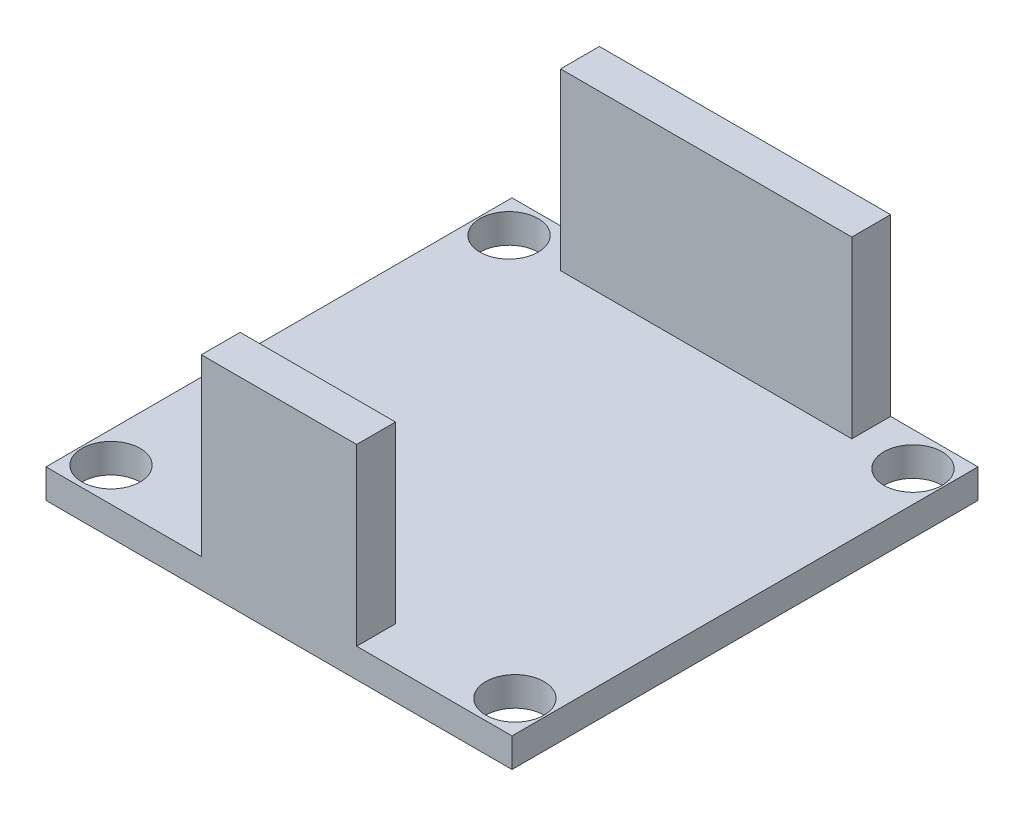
ISO-10303-21;
HEADER;
FILE_DESCRIPTION(('STEP AP214'),'2;1');
FILE_NAME('part.step','',(''),(''),'','','');
FILE_SCHEMA(('AUTOMOTIVE_DESIGN { 1 0 10303 214 1 1 1 1 }'));
ENDSEC;
DATA;
#1=APPLICATION_CONTEXT('core data for automotive mechanical design processes');
#2=APPLICATION_PROTOCOL_DEFINITION('international standard','automotive_design',2000,#1);
#3=PRODUCT_CONTEXT('',#1,'mechanical');
#4=PRODUCT('Part','Part','',(#3));
#5=PRODUCT_RELATED_PRODUCT_CATEGORY('part','',(#4));
#6=PRODUCT_DEFINITION_FORMATION('','',#4);
#7=PRODUCT_DEFINITION_CONTEXT('part definition',#1,'design');
#8=PRODUCT_DEFINITION('design','',#6,#7);
#9=PRODUCT_DEFINITION_SHAPE('','',#8);
#10=(LENGTH_UNIT() NAMED_UNIT(*) SI_UNIT(.MILLI.,.METRE.));
#11=(NAMED_UNIT(*) PLANE_ANGLE_UNIT() SI_UNIT($,.RADIAN.));
#12=(NAMED_UNIT(*) SI_UNIT($,.STERADIAN.) SOLID_ANGLE_UNIT());
#13=UNCERTAINTY_MEASURE_WITH_UNIT(LENGTH_MEASURE(1.E-05),#10,'distance_accuracy_value','');
#14=(GEOMETRIC_REPRESENTATION_CONTEXT(3) GLOBAL_UNCERTAINTY_ASSIGNED_CONTEXT((#13)) GLOBAL_UNIT_ASSIGNED_CONTEXT((#10,
#11,#12)) REPRESENTATION_CONTEXT('',''));
#15=CARTESIAN_POINT('',(0.,0.,0.));
#16=DIRECTION('',(0.,0.,1.));
#17=DIRECTION('',(1.,0.,0.));
#18=AXIS2_PLACEMENT_3D('',#15,#16,#17);
#19=CARTESIAN_POINT('',(0.,1.5,0.));
#20=DIRECTION('',(1.,0.,0.));
#21=DIRECTION('',(0.,0.,-1.));
#22=AXIS2_PLACEMENT_3D('',#19,#20,#21);
#23=PLANE('',#22);
#24=DIRECTION('',(0.,0.,1.));
#25=VECTOR('',#24,1.);
#26=CARTESIAN_POINT('',(0.,0.,0.));
#27=LINE('',#26,#25);
#28=CARTESIAN_POINT('',(0.,0.,0.));
#29=VERTEX_POINT('',#28);
#30=CARTESIAN_POINT('',(0.,0.,24.));
#31=VERTEX_POINT('',#30);
#32=EDGE_CURVE('E214',#29,#31,#27,.T.);
#33=ORIENTED_EDGE('',*,*,#32,.T.);
#34=DIRECTION('',(0.,-1.,0.));
#35=VECTOR('',#34,1.);
#36=CARTESIAN_POINT('',(0.,1.5,24.));
#37=LINE('',#36,#35);
#38=CARTESIAN_POINT('',(0.,1.5,24.));
#39=VERTEX_POINT('',#38);
#40=EDGE_CURVE('E11',#39,#31,#37,.T.);
#41=ORIENTED_EDGE('',*,*,#40,.F.);
#42=DIRECTION('',(0.,0.,1.));
#43=VECTOR('',#42,1.);
#44=CARTESIAN_POINT('',(0.,1.5,0.));
#45=LINE('',#44,#43);
#46=CARTESIAN_POINT('',(0.,1.5,0.));
#47=VERTEX_POINT('',#46);
#48=EDGE_CURVE('E217',#47,#39,#45,.T.);
#49=ORIENTED_EDGE('',*,*,#48,.F.);
#50=DIRECTION('',(0.,-1.,0.));
#51=VECTOR('',#50,1.);
#52=CARTESIAN_POINT('',(0.,1.5,0.));
#53=LINE('',#52,#51);
#54=EDGE_CURVE('E230',#47,#29,#53,.T.);
#55=ORIENTED_EDGE('',*,*,#54,.T.);
#56=EDGE_LOOP('',(#33,#41,#49,#55));
#57=FACE_BOUND('',#56,.T.);
#58=ADVANCED_FACE('F41',(#57),#23,.F.);
#59=CARTESIAN_POINT('',(0.,1.5,24.));
#60=DIRECTION('',(0.,0.,-1.));
#61=DIRECTION('',(-1.,0.,0.));
#62=AXIS2_PLACEMENT_3D('',#59,#60,#61);
#63=PLANE('',#62);
#64=DIRECTION('',(1.,0.,0.));
#65=VECTOR('',#64,1.);
#66=CARTESIAN_POINT('',(0.,0.,24.));
#67=LINE('',#66,#65);
#68=CARTESIAN_POINT('',(24.,0.,24.));
#69=VERTEX_POINT('',#68);
#70=EDGE_CURVE('E233',#31,#69,#67,.T.);
#71=ORIENTED_EDGE('',*,*,#70,.T.);
#72=DIRECTION('',(0.,-1.,0.));
#73=VECTOR('',#72,1.);
#74=CARTESIAN_POINT('',(24.,1.5,24.));
#75=LINE('',#74,#73);
#76=CARTESIAN_POINT('',(24.,1.5,24.));
#77=VERTEX_POINT('',#76);
#78=EDGE_CURVE('E48',#77,#69,#75,.T.);
#79=ORIENTED_EDGE('',*,*,#78,.F.);
#80=DIRECTION('',(1.,0.,0.));
#81=VECTOR('',#80,1.);
#82=CARTESIAN_POINT('',(0.,1.5,24.));
#83=LINE('',#82,#81);
#84=CARTESIAN_POINT('',(16.,1.5,24.));
#85=VERTEX_POINT('',#84);
#86=EDGE_CURVE('E220',#85,#77,#83,.T.);
#87=ORIENTED_EDGE('',*,*,#86,.F.);
#88=DIRECTION('',(0.,-1.,0.));
#89=VECTOR('',#88,1.);
#90=CARTESIAN_POINT('',(16.,10.5,24.));
#91=LINE('',#90,#89);
#92=CARTESIAN_POINT('',(16.,10.5,24.));
#93=VERTEX_POINT('',#92);
#94=EDGE_CURVE('E186',#93,#85,#91,.T.);
#95=ORIENTED_EDGE('',*,*,#94,.F.);
#96=DIRECTION('',(1.,0.,0.));
#97=VECTOR('',#96,1.);
#98=CARTESIAN_POINT('',(0.,10.5,24.));
#99=LINE('',#98,#97);
#100=CARTESIAN_POINT('',(8.,10.5,24.));
#101=VERTEX_POINT('',#100);
#102=EDGE_CURVE('E174',#101,#93,#99,.T.);
#103=ORIENTED_EDGE('',*,*,#102,.F.);
#104=DIRECTION('',(0.,-1.,0.));
#105=VECTOR('',#104,1.);
#106=CARTESIAN_POINT('',(8.,10.5,24.));
#107=LINE('',#106,#105);
#108=CARTESIAN_POINT('',(8.,1.5,24.));
#109=VERTEX_POINT('',#108);
#110=EDGE_CURVE('E188',#101,#109,#107,.T.);
#111=ORIENTED_EDGE('',*,*,#110,.T.);
#112=EDGE_CURVE('E222',#39,#109,#83,.T.);
#113=ORIENTED_EDGE('',*,*,#112,.F.);
#114=ORIENTED_EDGE('',*,*,#40,.T.);
#115=EDGE_LOOP('',(#71,#79,#87,#95,#103,#111,#113,#114));
#116=FACE_BOUND('',#115,.T.);
#117=ADVANCED_FACE('F269',(#116),#63,.F.);
#118=CARTESIAN_POINT('',(24.,1.5,0.));
#119=DIRECTION('',(-1.,0.,0.));
#120=DIRECTION('',(0.,0.,1.));
#121=AXIS2_PLACEMENT_3D('',#118,#119,#120);
#122=PLANE('',#121);
#123=DIRECTION('',(0.,0.,-1.));
#124=VECTOR('',#123,1.);
#125=CARTESIAN_POINT('',(24.,0.,0.));
#126=LINE('',#125,#124);
#127=CARTESIAN_POINT('',(24.,0.,0.));
#128=VERTEX_POINT('',#127);
#129=EDGE_CURVE('E235',#69,#128,#126,.T.);
#130=ORIENTED_EDGE('',*,*,#129,.T.);
#131=DIRECTION('',(0.,-1.,0.));
#132=VECTOR('',#131,1.);
#133=CARTESIAN_POINT('',(24.,1.5,0.));
#134=LINE('',#133,#132);
#135=CARTESIAN_POINT('',(24.,1.5,0.));
#136=VERTEX_POINT('',#135);
#137=EDGE_CURVE('E240',#136,#128,#134,.T.);
#138=ORIENTED_EDGE('',*,*,#137,.F.);
#139=DIRECTION('',(0.,0.,-1.));
#140=VECTOR('',#139,1.);
#141=CARTESIAN_POINT('',(24.,1.5,0.));
#142=LINE('',#141,#140);
#143=EDGE_CURVE('E225',#77,#136,#142,.T.);
#144=ORIENTED_EDGE('',*,*,#143,.F.);
#145=ORIENTED_EDGE('',*,*,#78,.T.);
#146=EDGE_LOOP('',(#130,#138,#144,#145));
#147=FACE_BOUND('',#146,.T.);
#148=ADVANCED_FACE('F247',(#147),#122,.F.);
#149=CARTESIAN_POINT('',(0.,1.5,0.));
#150=DIRECTION('',(0.,0.,1.));
#151=DIRECTION('',(1.,0.,0.));
#152=AXIS2_PLACEMENT_3D('',#149,#150,#151);
#153=PLANE('',#152);
#154=DIRECTION('',(-1.,0.,0.));
#155=VECTOR('',#154,1.);
#156=CARTESIAN_POINT('',(0.,0.,0.));
#157=LINE('',#156,#155);
#158=EDGE_CURVE('E221',#128,#29,#157,.T.);
#159=ORIENTED_EDGE('',*,*,#158,.T.);
#160=ORIENTED_EDGE('',*,*,#54,.F.);
#161=DIRECTION('',(-1.,0.,0.));
#162=VECTOR('',#161,1.);
#163=CARTESIAN_POINT('',(0.,1.5,0.));
#164=LINE('',#163,#162);
#165=CARTESIAN_POINT('',(4.5,1.5,0.));
#166=VERTEX_POINT('',#165);
#167=EDGE_CURVE('E227',#166,#47,#164,.T.);
#168=ORIENTED_EDGE('',*,*,#167,.F.);
#169=DIRECTION('',(0.,-1.,0.));
#170=VECTOR('',#169,1.);
#171=CARTESIAN_POINT('',(4.5,10.5,0.));
#172=LINE('',#171,#170);
#173=CARTESIAN_POINT('',(4.5,10.5,0.));
#174=VERTEX_POINT('',#173);
#175=EDGE_CURVE('E141',#174,#166,#172,.T.);
#176=ORIENTED_EDGE('',*,*,#175,.F.);
#177=DIRECTION('',(-1.,0.,0.));
#178=VECTOR('',#177,1.);
#179=CARTESIAN_POINT('',(0.,10.5,0.));
#180=LINE('',#179,#178);
#181=CARTESIAN_POINT('',(19.5,10.5,0.));
#182=VERTEX_POINT('',#181);
#183=EDGE_CURVE('E144',#182,#174,#180,.T.);
#184=ORIENTED_EDGE('',*,*,#183,.F.);
#185=DIRECTION('',(0.,-1.,0.));
#186=VECTOR('',#185,1.);
#187=CARTESIAN_POINT('',(19.5,10.5,0.));
#188=LINE('',#187,#186);
#189=CARTESIAN_POINT('',(19.5,1.5,0.));
#190=VERTEX_POINT('',#189);
#191=EDGE_CURVE('E131',#182,#190,#188,.T.);
#192=ORIENTED_EDGE('',*,*,#191,.T.);
#193=EDGE_CURVE('E228',#136,#190,#164,.T.);
#194=ORIENTED_EDGE('',*,*,#193,.F.);
#195=ORIENTED_EDGE('',*,*,#137,.T.);
#196=EDGE_LOOP('',(#159,#160,#168,#176,#184,#192,#194,#195));
#197=FACE_BOUND('',#196,.T.);
#198=ADVANCED_FACE('F145',(#197),#153,.F.);
#199=CARTESIAN_POINT('',(0.,1.5,0.));
#200=DIRECTION('',(0.,1.,0.));
#201=DIRECTION('',(0.,0.,1.));
#202=AXIS2_PLACEMENT_3D('',#199,#200,#201);
#203=PLANE('',#202);
#204=DIRECTION('',(0.,0.,1.));
#205=VECTOR('',#204,1.);
#206=CARTESIAN_POINT('',(19.5,1.5,0.));
#207=LINE('',#206,#205);
#208=CARTESIAN_POINT('',(19.5,1.5,2.));
#209=VERTEX_POINT('',#208);
#210=EDGE_CURVE('E137',#190,#209,#207,.T.);
#211=ORIENTED_EDGE('',*,*,#210,.T.);
#212=DIRECTION('',(1.,0.,0.));
#213=VECTOR('',#212,1.);
#214=CARTESIAN_POINT('',(0.,1.5,2.));
#215=LINE('',#214,#213);
#216=CARTESIAN_POINT('',(4.5,1.5,2.));
#217=VERTEX_POINT('',#216);
#218=EDGE_CURVE('E154',#217,#209,#215,.T.);
#219=ORIENTED_EDGE('',*,*,#218,.F.);
#220=DIRECTION('',(0.,0.,1.));
#221=VECTOR('',#220,1.);
#222=CARTESIAN_POINT('',(4.5,1.5,0.));
#223=LINE('',#222,#221);
#224=EDGE_CURVE('E156',#166,#217,#223,.T.);
#225=ORIENTED_EDGE('',*,*,#224,.F.);
#226=ORIENTED_EDGE('',*,*,#167,.T.);
#227=ORIENTED_EDGE('',*,*,#48,.T.);
#228=ORIENTED_EDGE('',*,*,#112,.T.);
#229=DIRECTION('',(0.,0.,-1.));
#230=VECTOR('',#229,1.);
#231=CARTESIAN_POINT('',(8.,1.5,0.));
#232=LINE('',#231,#230);
#233=CARTESIAN_POINT('',(8.,1.5,22.));
#234=VERTEX_POINT('',#233);
#235=EDGE_CURVE('E180',#109,#234,#232,.T.);
#236=ORIENTED_EDGE('',*,*,#235,.T.);
#237=DIRECTION('',(1.,0.,0.));
#238=VECTOR('',#237,1.);
#239=CARTESIAN_POINT('',(0.,1.5,22.));
#240=LINE('',#239,#238);
#241=CARTESIAN_POINT('',(16.,1.5,22.));
#242=VERTEX_POINT('',#241);
#243=EDGE_CURVE('E63',#234,#242,#240,.T.);
#244=ORIENTED_EDGE('',*,*,#243,.T.);
#245=DIRECTION('',(0.,0.,-1.));
#246=VECTOR('',#245,1.);
#247=CARTESIAN_POINT('',(16.,1.5,0.));
#248=LINE('',#247,#246);
#249=EDGE_CURVE('E171',#85,#242,#248,.T.);
#250=ORIENTED_EDGE('',*,*,#249,.F.);
#251=ORIENTED_EDGE('',*,*,#86,.T.);
#252=ORIENTED_EDGE('',*,*,#143,.T.);
#253=ORIENTED_EDGE('',*,*,#193,.T.);
#254=EDGE_LOOP('',(#211,#219,#225,#226,#227,#228,#236,#244,#250,#251,#252,#253));
#255=FACE_BOUND('',#254,.T.);
#256=CARTESIAN_POINT('',(1.6,1.5,1.75));
#257=DIRECTION('',(0.,1.,0.));
#258=DIRECTION('',(0.,0.,-1.));
#259=AXIS2_PLACEMENT_3D('',#256,#257,#258);
#260=CIRCLE('',#259,1.5);
#261=CARTESIAN_POINT('',(1.6,1.5,0.25));
#262=VERTEX_POINT('',#261);
#263=EDGE_CURVE('E192',#262,#262,#260,.T.);
#264=ORIENTED_EDGE('',*,*,#263,.F.);
#265=EDGE_LOOP('',(#264));
#266=FACE_BOUND('',#265,.T.);
#267=CARTESIAN_POINT('',(1.6,1.5,22.25));
#268=DIRECTION('',(0.,1.,0.));
#269=DIRECTION('',(0.,0.,1.));
#270=AXIS2_PLACEMENT_3D('',#267,#268,#269);
#271=CIRCLE('',#270,1.5);
#272=CARTESIAN_POINT('',(1.6,1.5,23.75));
#273=VERTEX_POINT('',#272);
#274=EDGE_CURVE('E203',#273,#273,#271,.T.);
#275=ORIENTED_EDGE('',*,*,#274,.F.);
#276=EDGE_LOOP('',(#275));
#277=FACE_BOUND('',#276,.T.);
#278=CARTESIAN_POINT('',(22.4,1.5,22.25));
#279=DIRECTION('',(0.,1.,0.));
#280=DIRECTION('',(0.,0.,-1.));
#281=AXIS2_PLACEMENT_3D('',#278,#279,#280);
#282=CIRCLE('',#281,1.5);
#283=CARTESIAN_POINT('',(22.4,1.5,20.75));
#284=VERTEX_POINT('',#283);
#285=EDGE_CURVE('E197',#284,#284,#282,.T.);
#286=ORIENTED_EDGE('',*,*,#285,.F.);
#287=EDGE_LOOP('',(#286));
#288=FACE_BOUND('',#287,.T.);
#289=CARTESIAN_POINT('',(22.4,1.5,1.75));
#290=DIRECTION('',(0.,1.,0.));
#291=DIRECTION('',(0.,0.,1.));
#292=AXIS2_PLACEMENT_3D('',#289,#290,#291);
#293=CIRCLE('',#292,1.5);
#294=CARTESIAN_POINT('',(22.4,1.5,3.25));
#295=VERTEX_POINT('',#294);
#296=EDGE_CURVE('E196',#295,#295,#293,.T.);
#297=ORIENTED_EDGE('',*,*,#296,.F.);
#298=EDGE_LOOP('',(#297));
#299=FACE_BOUND('',#298,.T.);
#300=ADVANCED_FACE('F260',(#255,#266,#277,#288,#299),#203,.T.);
#301=CARTESIAN_POINT('',(0.,0.,0.));
#302=DIRECTION('',(0.,1.,0.));
#303=DIRECTION('',(0.,0.,1.));
#304=AXIS2_PLACEMENT_3D('',#301,#302,#303);
#305=PLANE('',#304);
#306=CARTESIAN_POINT('',(1.6,0.,1.75));
#307=DIRECTION('',(0.,1.,0.));
#308=DIRECTION('',(0.,0.,-1.));
#309=AXIS2_PLACEMENT_3D('',#306,#307,#308);
#310=CIRCLE('',#309,1.5);
#311=CARTESIAN_POINT('',(1.6,0.,0.25));
#312=VERTEX_POINT('',#311);
#313=EDGE_CURVE('E206',#312,#312,#310,.T.);
#314=ORIENTED_EDGE('',*,*,#313,.T.);
#315=EDGE_LOOP('',(#314));
#316=FACE_BOUND('',#315,.T.);
#317=CARTESIAN_POINT('',(1.6,0.,22.25));
#318=DIRECTION('',(0.,1.,0.));
#319=DIRECTION('',(0.,0.,1.));
#320=AXIS2_PLACEMENT_3D('',#317,#318,#319);
#321=CIRCLE('',#320,1.5);
#322=CARTESIAN_POINT('',(1.6,0.,23.75));
#323=VERTEX_POINT('',#322);
#324=EDGE_CURVE('E200',#323,#323,#321,.T.);
#325=ORIENTED_EDGE('',*,*,#324,.T.);
#326=EDGE_LOOP('',(#325));
#327=FACE_BOUND('',#326,.T.);
#328=CARTESIAN_POINT('',(22.4,0.,22.25));
#329=DIRECTION('',(0.,1.,0.));
#330=DIRECTION('',(0.,0.,-1.));
#331=AXIS2_PLACEMENT_3D('',#328,#329,#330);
#332=CIRCLE('',#331,1.5);
#333=CARTESIAN_POINT('',(22.4,0.,20.75));
#334=VERTEX_POINT('',#333);
#335=EDGE_CURVE('E193',#334,#334,#332,.T.);
#336=ORIENTED_EDGE('',*,*,#335,.T.);
#337=EDGE_LOOP('',(#336));
#338=FACE_BOUND('',#337,.T.);
#339=CARTESIAN_POINT('',(22.4,0.,1.75));
#340=DIRECTION('',(0.,1.,0.));
#341=DIRECTION('',(0.,0.,1.));
#342=AXIS2_PLACEMENT_3D('',#339,#340,#341);
#343=CIRCLE('',#342,1.5);
#344=CARTESIAN_POINT('',(22.4,0.,3.25));
#345=VERTEX_POINT('',#344);
#346=EDGE_CURVE('E211',#345,#345,#343,.T.);
#347=ORIENTED_EDGE('',*,*,#346,.T.);
#348=EDGE_LOOP('',(#347));
#349=FACE_BOUND('',#348,.T.);
#350=ORIENTED_EDGE('',*,*,#32,.F.);
#351=ORIENTED_EDGE('',*,*,#158,.F.);
#352=ORIENTED_EDGE('',*,*,#129,.F.);
#353=ORIENTED_EDGE('',*,*,#70,.F.);
#354=EDGE_LOOP('',(#350,#351,#352,#353));
#355=FACE_BOUND('',#354,.T.);
#356=ADVANCED_FACE('F254',(#316,#327,#338,#349,#355),#305,.F.);
#357=CARTESIAN_POINT('',(22.4,0.,1.75));
#358=DIRECTION('',(0.,1.,0.));
#359=DIRECTION('',(0.,0.,1.));
#360=AXIS2_PLACEMENT_3D('',#357,#358,#359);
#361=CYLINDRICAL_SURFACE('',#360,1.5);
#362=ORIENTED_EDGE('',*,*,#346,.F.);
#363=EDGE_LOOP('',(#362));
#364=FACE_BOUND('',#363,.T.);
#365=ORIENTED_EDGE('',*,*,#296,.T.);
#366=EDGE_LOOP('',(#365));
#367=FACE_BOUND('',#366,.T.);
#368=ADVANCED_FACE('F308',(#364,#367),#361,.F.);
#369=CARTESIAN_POINT('',(22.4,0.,22.25));
#370=DIRECTION('',(0.,1.,0.));
#371=DIRECTION('',(0.,0.,1.));
#372=AXIS2_PLACEMENT_3D('',#369,#370,#371);
#373=CYLINDRICAL_SURFACE('',#372,1.5);
#374=ORIENTED_EDGE('',*,*,#335,.F.);
#375=EDGE_LOOP('',(#374));
#376=FACE_BOUND('',#375,.T.);
#377=ORIENTED_EDGE('',*,*,#285,.T.);
#378=EDGE_LOOP('',(#377));
#379=FACE_BOUND('',#378,.T.);
#380=ADVANCED_FACE('F313',(#376,#379),#373,.F.);
#381=CARTESIAN_POINT('',(1.6,0.,22.25));
#382=DIRECTION('',(0.,1.,0.));
#383=DIRECTION('',(0.,0.,1.));
#384=AXIS2_PLACEMENT_3D('',#381,#382,#383);
#385=CYLINDRICAL_SURFACE('',#384,1.5);
#386=ORIENTED_EDGE('',*,*,#324,.F.);
#387=EDGE_LOOP('',(#386));
#388=FACE_BOUND('',#387,.T.);
#389=ORIENTED_EDGE('',*,*,#274,.T.);
#390=EDGE_LOOP('',(#389));
#391=FACE_BOUND('',#390,.T.);
#392=ADVANCED_FACE('F291',(#388,#391),#385,.F.);
#393=CARTESIAN_POINT('',(1.6,0.,1.75));
#394=DIRECTION('',(0.,1.,0.));
#395=DIRECTION('',(0.,0.,1.));
#396=AXIS2_PLACEMENT_3D('',#393,#394,#395);
#397=CYLINDRICAL_SURFACE('',#396,1.5);
#398=ORIENTED_EDGE('',*,*,#313,.F.);
#399=EDGE_LOOP('',(#398));
#400=FACE_BOUND('',#399,.T.);
#401=ORIENTED_EDGE('',*,*,#263,.T.);
#402=EDGE_LOOP('',(#401));
#403=FACE_BOUND('',#402,.T.);
#404=ADVANCED_FACE('F284',(#400,#403),#397,.F.);
#405=CARTESIAN_POINT('',(0.,10.5,22.));
#406=DIRECTION('',(0.,0.,-1.));
#407=DIRECTION('',(-1.,0.,0.));
#408=AXIS2_PLACEMENT_3D('',#405,#406,#407);
#409=PLANE('',#408);
#410=ORIENTED_EDGE('',*,*,#243,.F.);
#411=DIRECTION('',(0.,-1.,0.));
#412=VECTOR('',#411,1.);
#413=CARTESIAN_POINT('',(8.,10.5,22.));
#414=LINE('',#413,#412);
#415=CARTESIAN_POINT('',(8.,10.5,22.));
#416=VERTEX_POINT('',#415);
#417=EDGE_CURVE('E190',#416,#234,#414,.T.);
#418=ORIENTED_EDGE('',*,*,#417,.F.);
#419=DIRECTION('',(1.,0.,0.));
#420=VECTOR('',#419,1.);
#421=CARTESIAN_POINT('',(0.,10.5,22.));
#422=LINE('',#421,#420);
#423=CARTESIAN_POINT('',(16.,10.5,22.));
#424=VERTEX_POINT('',#423);
#425=EDGE_CURVE('E167',#416,#424,#422,.T.);
#426=ORIENTED_EDGE('',*,*,#425,.T.);
#427=DIRECTION('',(0.,-1.,0.));
#428=VECTOR('',#427,1.);
#429=CARTESIAN_POINT('',(16.,10.5,22.));
#430=LINE('',#429,#428);
#431=EDGE_CURVE('E178',#424,#242,#430,.T.);
#432=ORIENTED_EDGE('',*,*,#431,.T.);
#433=EDGE_LOOP('',(#410,#418,#426,#432));
#434=FACE_BOUND('',#433,.T.);
#435=ADVANCED_FACE('F282',(#434),#409,.T.);
#436=CARTESIAN_POINT('',(8.,10.5,0.));
#437=DIRECTION('',(-1.,0.,0.));
#438=DIRECTION('',(0.,0.,1.));
#439=AXIS2_PLACEMENT_3D('',#436,#437,#438);
#440=PLANE('',#439);
#441=ORIENTED_EDGE('',*,*,#235,.F.);
#442=ORIENTED_EDGE('',*,*,#110,.F.);
#443=DIRECTION('',(0.,0.,-1.));
#444=VECTOR('',#443,1.);
#445=CARTESIAN_POINT('',(8.,10.5,0.));
#446=LINE('',#445,#444);
#447=EDGE_CURVE('E170',#101,#416,#446,.T.);
#448=ORIENTED_EDGE('',*,*,#447,.T.);
#449=ORIENTED_EDGE('',*,*,#417,.T.);
#450=EDGE_LOOP('',(#441,#442,#448,#449));
#451=FACE_BOUND('',#450,.T.);
#452=ADVANCED_FACE('F281',(#451),#440,.T.);
#453=CARTESIAN_POINT('',(16.,10.5,0.));
#454=DIRECTION('',(-1.,0.,0.));
#455=DIRECTION('',(0.,0.,1.));
#456=AXIS2_PLACEMENT_3D('',#453,#454,#455);
#457=PLANE('',#456);
#458=ORIENTED_EDGE('',*,*,#249,.T.);
#459=ORIENTED_EDGE('',*,*,#431,.F.);
#460=DIRECTION('',(0.,0.,-1.));
#461=VECTOR('',#460,1.);
#462=CARTESIAN_POINT('',(16.,10.5,0.));
#463=LINE('',#462,#461);
#464=EDGE_CURVE('E176',#93,#424,#463,.T.);
#465=ORIENTED_EDGE('',*,*,#464,.F.);
#466=ORIENTED_EDGE('',*,*,#94,.T.);
#467=EDGE_LOOP('',(#458,#459,#465,#466));
#468=FACE_BOUND('',#467,.T.);
#469=ADVANCED_FACE('F275',(#468),#457,.F.);
#470=CARTESIAN_POINT('',(0.,10.5,0.));
#471=DIRECTION('',(0.,1.,0.));
#472=DIRECTION('',(0.,0.,1.));
#473=AXIS2_PLACEMENT_3D('',#470,#471,#472);
#474=PLANE('',#473);
#475=ORIENTED_EDGE('',*,*,#425,.F.);
#476=ORIENTED_EDGE('',*,*,#447,.F.);
#477=ORIENTED_EDGE('',*,*,#102,.T.);
#478=ORIENTED_EDGE('',*,*,#464,.T.);
#479=EDGE_LOOP('',(#475,#476,#477,#478));
#480=FACE_BOUND('',#479,.T.);
#481=ADVANCED_FACE('F278',(#480),#474,.T.);
#482=CARTESIAN_POINT('',(19.5,10.5,0.));
#483=DIRECTION('',(1.,0.,0.));
#484=DIRECTION('',(0.,0.,-1.));
#485=AXIS2_PLACEMENT_3D('',#482,#483,#484);
#486=PLANE('',#485);
#487=ORIENTED_EDGE('',*,*,#210,.F.);
#488=ORIENTED_EDGE('',*,*,#191,.F.);
#489=DIRECTION('',(0.,0.,1.));
#490=VECTOR('',#489,1.);
#491=CARTESIAN_POINT('',(19.5,10.5,0.));
#492=LINE('',#491,#490);
#493=CARTESIAN_POINT('',(19.5,10.5,2.));
#494=VERTEX_POINT('',#493);
#495=EDGE_CURVE('E135',#182,#494,#492,.T.);
#496=ORIENTED_EDGE('',*,*,#495,.T.);
#497=DIRECTION('',(0.,-1.,0.));
#498=VECTOR('',#497,1.);
#499=CARTESIAN_POINT('',(19.5,10.5,2.));
#500=LINE('',#499,#498);
#501=EDGE_CURVE('E161',#494,#209,#500,.T.);
#502=ORIENTED_EDGE('',*,*,#501,.T.);
#503=EDGE_LOOP('',(#487,#488,#496,#502));
#504=FACE_BOUND('',#503,.T.);
#505=ADVANCED_FACE('F133',(#504),#486,.T.);
#506=CARTESIAN_POINT('',(4.5,10.5,0.));
#507=DIRECTION('',(1.,0.,0.));
#508=DIRECTION('',(0.,0.,-1.));
#509=AXIS2_PLACEMENT_3D('',#506,#507,#508);
#510=PLANE('',#509);
#511=ORIENTED_EDGE('',*,*,#224,.T.);
#512=DIRECTION('',(0.,-1.,0.));
#513=VECTOR('',#512,1.);
#514=CARTESIAN_POINT('',(4.5,10.5,2.));
#515=LINE('',#514,#513);
#516=CARTESIAN_POINT('',(4.5,10.5,2.));
#517=VERTEX_POINT('',#516);
#518=EDGE_CURVE('E55',#517,#217,#515,.T.);
#519=ORIENTED_EDGE('',*,*,#518,.F.);
#520=DIRECTION('',(0.,0.,1.));
#521=VECTOR('',#520,1.);
#522=CARTESIAN_POINT('',(4.5,10.5,0.));
#523=LINE('',#522,#521);
#524=EDGE_CURVE('E149',#174,#517,#523,.T.);
#525=ORIENTED_EDGE('',*,*,#524,.F.);
#526=ORIENTED_EDGE('',*,*,#175,.T.);
#527=EDGE_LOOP('',(#511,#519,#525,#526));
#528=FACE_BOUND('',#527,.T.);
#529=ADVANCED_FACE('F265',(#528),#510,.F.);
#530=CARTESIAN_POINT('',(0.,10.5,2.));
#531=DIRECTION('',(0.,0.,-1.));
#532=DIRECTION('',(-1.,0.,0.));
#533=AXIS2_PLACEMENT_3D('',#530,#531,#532);
#534=PLANE('',#533);
#535=ORIENTED_EDGE('',*,*,#218,.T.);
#536=ORIENTED_EDGE('',*,*,#501,.F.);
#537=DIRECTION('',(1.,0.,0.));
#538=VECTOR('',#537,1.);
#539=CARTESIAN_POINT('',(0.,10.5,2.));
#540=LINE('',#539,#538);
#541=EDGE_CURVE('E152',#517,#494,#540,.T.);
#542=ORIENTED_EDGE('',*,*,#541,.F.);
#543=ORIENTED_EDGE('',*,*,#518,.T.);
#544=EDGE_LOOP('',(#535,#536,#542,#543));
#545=FACE_BOUND('',#544,.T.);
#546=ADVANCED_FACE('F266',(#545),#534,.F.);
#547=CARTESIAN_POINT('',(0.,10.5,0.));
#548=DIRECTION('',(0.,1.,0.));
#549=DIRECTION('',(0.,0.,1.));
#550=AXIS2_PLACEMENT_3D('',#547,#548,#549);
#551=PLANE('',#550);
#552=ORIENTED_EDGE('',*,*,#495,.F.);
#553=ORIENTED_EDGE('',*,*,#183,.T.);
#554=ORIENTED_EDGE('',*,*,#524,.T.);
#555=ORIENTED_EDGE('',*,*,#541,.T.);
#556=EDGE_LOOP('',(#552,#553,#554,#555));
#557=FACE_BOUND('',#556,.T.);
#558=ADVANCED_FACE('F151',(#557),#551,.T.);
#559=CLOSED_SHELL('',(#58,#117,#148,#198,#300,#356,#368,#380,#392,#404,#435,#452,#469,#481,#505,
#529,#546,#558));
#560=MANIFOLD_SOLID_BREP('B2',#559);
#561=ADVANCED_BREP_SHAPE_REPRESENTATION('',(#18,#560),#14);
#562=SHAPE_DEFINITION_REPRESENTATION(#9,#561);
ENDSEC;
END-ISO-10303-21;
